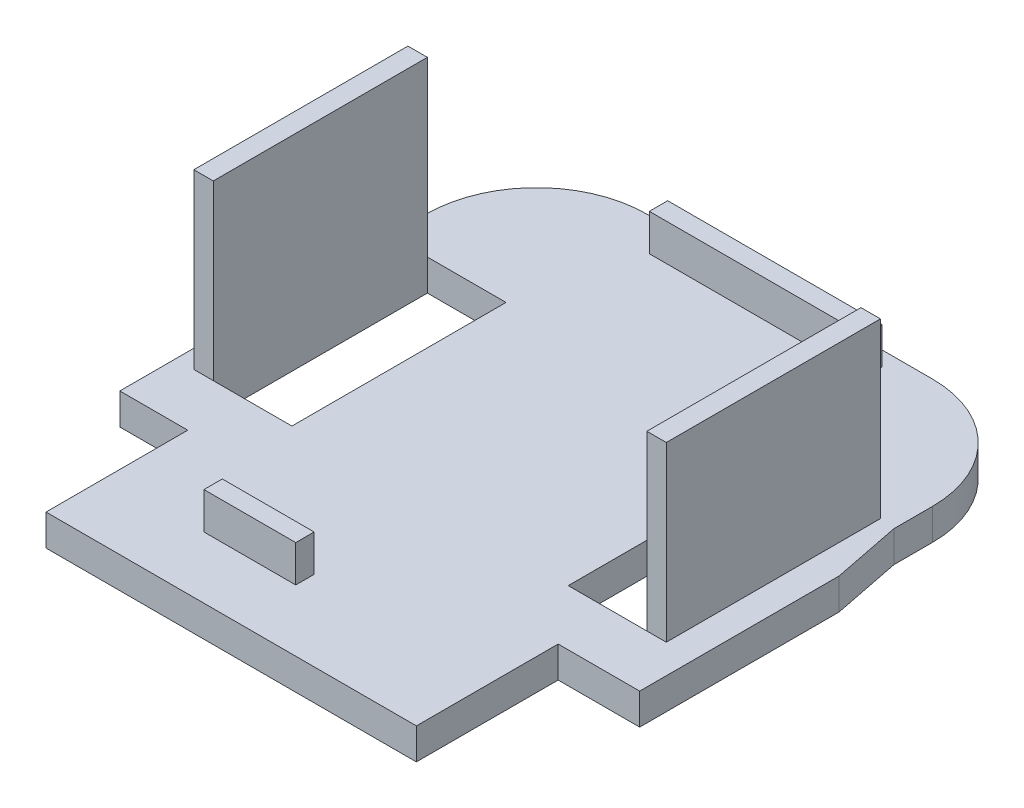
from build123d import *

# Parameters (mm, degrees)
BOSS_EXTRUDE1_DEPTH = 2.159
SKETCH2_W           = 14.8336
SKETCH2_H           = 1.27
SKETCH2_W_2         = 6.35
BOSS_EXTRUDE2_DEPTH = 2.54
SKETCH3_W           = 1.3462
SKETCH3_H           = 14.8082
BOSS_EXTRUDE3_DEPTH = 11.9634
SKETCH4_W           = 5.4356
SKETCH4_H           = 14.8082
CUT_EXTRUDE1_DEPTH  = 52.103206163


with BuildPart() as part:
    # Sketch1 → Boss-Extrude1 (new body)
    with BuildSketch(Plane(origin=(0, 0, 0), x_dir=(1, 0, 0), z_dir=(0, 1, 0))):
        with BuildLine():
            Line((0, 0), (0, 9.8044))
            Line((0, 9.8044), (-4.699, 9.8044))
            Line((-4.699, 9.8044), (-4.699, 31.0007))
            ThreePointArc((-4.699, 31.0007), (-2.467153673, 36.388853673), (2.921, 38.6207))
            Line((2.921, 38.6207), (22.6949, 38.6207))
            ThreePointArc((22.6949, 38.6207), (28.083053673, 36.388853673), (30.3149, 31.0007))
            Line((30.3149, 31.0007), (30.3149, 28.330208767))
            Line((30.3149, 28.330208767), (31.2547, 23.5966))
            Line((31.2547, 23.5966), (31.2547, 9.8044))
            Line((31.2547, 9.8044), (25.6159, 9.8044))
            Line((25.6159, 9.8044), (25.6159, 0))
            Line((25.6159, 0), (0, 0))
        make_face()
    extrude(amount=BOSS_EXTRUDE1_DEPTH)

    # Sketch2 → Boss-Extrude2 (add)
    with BuildSketch(Plane(origin=(0, 2.159, 0), x_dir=(1, 0, 0), z_dir=(0, 1, 0))):
        with Locations((12.80795, 36.9697)):
            Rectangle(SKETCH2_W, SKETCH2_H)
        with Locations((9.8298, 4.9022)):
            Rectangle(SKETCH2_W_2, SKETCH2_H)
    extrude(amount=BOSS_EXTRUDE2_DEPTH)

    # Sketch3 → Boss-Extrude3 (add)
    with BuildSketch(Plane(origin=(0, 2.159, 0), x_dir=(1, 0, 0), z_dir=(0, 1, 0))):
        with Locations((-2.7559, 21.0566)):
            Rectangle(SKETCH3_W, SKETCH3_H)
        with Locations((28.575, 21.0566)):
            Rectangle(SKETCH3_W, SKETCH3_H)
    extrude(amount=BOSS_EXTRUDE3_DEPTH)

    # Sketch4 → Cut-Extrude1 (cut, through all)
    with BuildSketch(Plane(origin=(0, 2.159, 0), x_dir=(1, 0, 0), z_dir=(0, 1, 0))):
        with Locations((0.635, 21.0566)):
            Rectangle(SKETCH4_W, SKETCH4_H)
        with Locations((25.1841, 21.0566)):
            Rectangle(SKETCH4_W, SKETCH4_H)
    extrude(amount=-CUT_EXTRUDE1_DEPTH, mode=Mode.SUBTRACT)


solid = part.part
